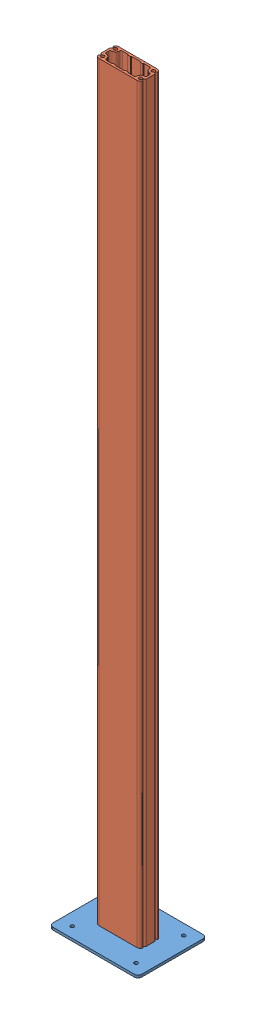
SolidWorks assembly Ensamble perfil-suelo(anclaje macho).SLDASM, configuration Predeterminado (file format 12000). Lengths in mm.
Overall size (355 3010 275).
2 component instances, 2 part files, 3 mates.
Components (placement in the parent):
- Anclaje macho-1: Anclaje macho.SLDPRT [Predeterminado] at origin size (355 160 275)
- Principal 3m-2: Principal 3m.SLDPRT [Predeterminado] at origin size (180 3000 80)
Mates (geometry in assembly coordinates):
- Coincidente1: coincident anti-aligned: plane of Anclaje macho-1 through (-82 150 0) normal (-1 0 0); plane of Principal 3m-2 through (-82 3000 -4.5) normal (1 0 0)
- Coincidente2: coincident anti-aligned: plane of Anclaje macho-1 through (0 150 32) normal (0 0 1); plane of Principal 3m-2 through (-17.4827 3000 32) normal (0 0 -1)
- Coincidente3: coincident anti-aligned: plane of Anclaje macho-1 through (0 0 0) normal (0 1 0); plane of Principal 3m-2 through (84.6939 0 -30.5718) normal (0 -1 0)
